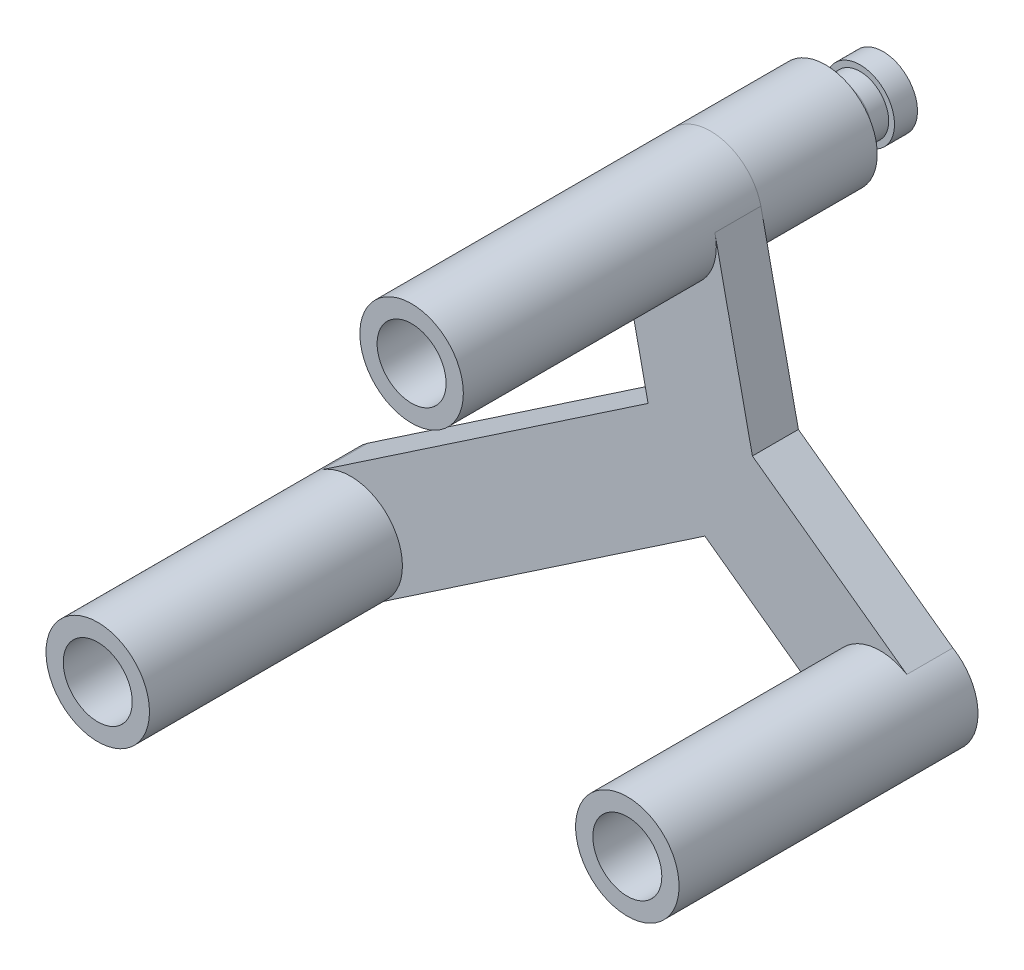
ISO-10303-21;
HEADER;
FILE_DESCRIPTION(('STEP AP214'),'2;1');
FILE_NAME('part.step','',(''),(''),'','','');
FILE_SCHEMA(('AUTOMOTIVE_DESIGN { 1 0 10303 214 1 1 1 1 }'));
ENDSEC;
DATA;
#1=APPLICATION_CONTEXT('core data for automotive mechanical design processes');
#2=APPLICATION_PROTOCOL_DEFINITION('international standard','automotive_design',2000,#1);
#3=PRODUCT_CONTEXT('',#1,'mechanical');
#4=PRODUCT('Part','Part','',(#3));
#5=PRODUCT_RELATED_PRODUCT_CATEGORY('part','',(#4));
#6=PRODUCT_DEFINITION_FORMATION('','',#4);
#7=PRODUCT_DEFINITION_CONTEXT('part definition',#1,'design');
#8=PRODUCT_DEFINITION('design','',#6,#7);
#9=PRODUCT_DEFINITION_SHAPE('','',#8);
#10=(LENGTH_UNIT() NAMED_UNIT(*) SI_UNIT(.MILLI.,.METRE.));
#11=(NAMED_UNIT(*) PLANE_ANGLE_UNIT() SI_UNIT($,.RADIAN.));
#12=(NAMED_UNIT(*) SI_UNIT($,.STERADIAN.) SOLID_ANGLE_UNIT());
#13=UNCERTAINTY_MEASURE_WITH_UNIT(LENGTH_MEASURE(1.E-05),#10,'distance_accuracy_value','');
#14=(GEOMETRIC_REPRESENTATION_CONTEXT(3) GLOBAL_UNCERTAINTY_ASSIGNED_CONTEXT((#13)) GLOBAL_UNIT_ASSIGNED_CONTEXT((#10,
#11,#12)) REPRESENTATION_CONTEXT('',''));
#15=CARTESIAN_POINT('',(0.,0.,0.));
#16=DIRECTION('',(0.,0.,1.));
#17=DIRECTION('',(1.,0.,0.));
#18=AXIS2_PLACEMENT_3D('',#15,#16,#17);
#19=CARTESIAN_POINT('',(0.,0.,-4.));
#20=DIRECTION('',(0.,0.,1.));
#21=DIRECTION('',(1.,0.,0.));
#22=AXIS2_PLACEMENT_3D('',#19,#20,#21);
#23=PLANE('',#22);
#24=CARTESIAN_POINT('',(-3.59848546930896,16.7570367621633,-4.));
#25=DIRECTION('',(0.,0.,-1.));
#26=DIRECTION('',(-1.,0.,0.));
#27=AXIS2_PLACEMENT_3D('',#24,#25,#26);
#28=CIRCLE('',#27,4.49893757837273);
#29=CARTESIAN_POINT('',(-8.04749548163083,16.0886437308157,-4.));
#30=VERTEX_POINT('',#29);
#31=CARTESIAN_POINT('',(0.80017246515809,17.7016254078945,-4.));
#32=VERTEX_POINT('',#31);
#33=EDGE_CURVE('E58',#30,#32,#28,.T.);
#34=ORIENTED_EDGE('',*,*,#33,.F.);
#35=DIRECTION('',(-0.209958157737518,0.977710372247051,0.));
#36=VECTOR('',#35,1.);
#37=CARTESIAN_POINT('',(-4.39009341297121,-0.942749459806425,-4.));
#38=LINE('',#37,#36);
#39=CARTESIAN_POINT('',(-8.05096977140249,16.1048224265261,-4.));
#40=VERTEX_POINT('',#39);
#41=EDGE_CURVE('E215',#30,#40,#38,.T.);
#42=ORIENTED_EDGE('',*,*,#41,.T.);
#43=CARTESIAN_POINT('',(-3.59848546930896,16.7570367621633,-4.));
#44=DIRECTION('',(0.,0.,1.));
#45=DIRECTION('',(1.,0.,0.));
#46=AXIS2_PLACEMENT_3D('',#43,#44,#45);
#47=CIRCLE('',#46,4.5);
#48=CARTESIAN_POINT('',(0.779643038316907,17.7972246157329,-4.));
#49=VERTEX_POINT('',#48);
#50=EDGE_CURVE('E212',#49,#40,#47,.T.);
#51=ORIENTED_EDGE('',*,*,#50,.F.);
#52=DIRECTION('',(0.209958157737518,-0.977710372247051,0.));
#53=VECTOR('',#52,1.);
#54=CARTESIAN_POINT('',(4.39865793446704,0.944588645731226,-4.));
#55=LINE('',#54,#53);
#56=EDGE_CURVE('E210',#49,#32,#55,.T.);
#57=ORIENTED_EDGE('',*,*,#56,.T.);
#58=EDGE_LOOP('',(#34,#42,#51,#57));
#59=FACE_BOUND('',#58,.T.);
#60=ADVANCED_FACE('F35',(#59),#23,.F.);
#61=CARTESIAN_POINT('',(0.,0.,0.));
#62=DIRECTION('',(0.,0.,1.));
#63=DIRECTION('',(1.,0.,0.));
#64=AXIS2_PLACEMENT_3D('',#61,#62,#63);
#65=PLANE('',#64);
#66=DIRECTION('',(0.809551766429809,-0.587048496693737,0.));
#67=VECTOR('',#66,1.);
#68=CARTESIAN_POINT('',(-2.64171823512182,-3.64298294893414,0.));
#69=LINE('',#68,#67);
#70=CARTESIAN_POINT('',(-0.0904885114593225,-5.49301359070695,0.));
#71=VERTEX_POINT('',#70);
#72=CARTESIAN_POINT('',(12.521976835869,-14.6389745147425,0.));
#73=VERTEX_POINT('',#72);
#74=EDGE_CURVE('E218',#71,#73,#69,.T.);
#75=ORIENTED_EDGE('',*,*,#74,.T.);
#76=CARTESIAN_POINT('',(15.1636950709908,-10.9959915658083,0.));
#77=DIRECTION('',(0.,0.,1.));
#78=DIRECTION('',(1.,0.,0.));
#79=AXIS2_PLACEMENT_3D('',#76,#77,#78);
#80=CIRCLE('',#79,4.5);
#81=CARTESIAN_POINT('',(17.4737197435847,-7.13415443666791,0.));
#82=VERTEX_POINT('',#81);
#83=EDGE_CURVE('E176',#82,#73,#80,.T.);
#84=ORIENTED_EDGE('',*,*,#83,.F.);
#85=DIRECTION('',(0.809551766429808,-0.587048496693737,0.));
#86=VECTOR('',#85,1.);
#87=CARTESIAN_POINT('',(2.63141763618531,3.62877821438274,0.));
#88=LINE('',#87,#86);
#89=CARTESIAN_POINT('',(4.04188395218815,2.60597502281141,0.));
#90=VERTEX_POINT('',#89);
#91=EDGE_CURVE('E270',#90,#82,#88,.T.);
#92=ORIENTED_EDGE('',*,*,#91,.F.);
#93=DIRECTION('',(0.209958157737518,-0.977710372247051,0.));
#94=VECTOR('',#93,1.);
#95=CARTESIAN_POINT('',(4.39865793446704,0.944588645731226,0.));
#96=LINE('',#95,#94);
#97=CARTESIAN_POINT('',(0.820701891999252,17.6060262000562,0.));
#98=VERTEX_POINT('',#97);
#99=EDGE_CURVE('E268',#98,#90,#96,.T.);
#100=ORIENTED_EDGE('',*,*,#99,.F.);
#101=CARTESIAN_POINT('',(-3.59848546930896,16.7570367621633,0.));
#102=DIRECTION('',(0.,0.,1.));
#103=DIRECTION('',(1.,0.,0.));
#104=AXIS2_PLACEMENT_3D('',#101,#102,#103);
#105=CIRCLE('',#104,4.5);
#106=CARTESIAN_POINT('',(-7.92618799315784,15.5237521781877,0.));
#107=VERTEX_POINT('',#106);
#108=EDGE_CURVE('E187',#107,#98,#105,.T.);
#109=ORIENTED_EDGE('',*,*,#108,.F.);
#110=DIRECTION('',(-0.209958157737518,0.977710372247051,0.));
#111=VECTOR('',#110,1.);
#112=CARTESIAN_POINT('',(-4.39009341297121,-0.942749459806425,0.));
#113=LINE('',#112,#111);
#114=CARTESIAN_POINT('',(-5.02892290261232,2.03208240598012,0.));
#115=VERTEX_POINT('',#114);
#116=EDGE_CURVE('E195',#115,#107,#113,.T.);
#117=ORIENTED_EDGE('',*,*,#116,.F.);
#118=DIRECTION('',(0.828448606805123,0.560065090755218,0.));
#119=VECTOR('',#118,1.);
#120=CARTESIAN_POINT('',(-2.52029290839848,3.72801873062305,0.));
#121=LINE('',#120,#119);
#122=CARTESIAN_POINT('',(-33.4165334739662,-17.1591016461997,0.));
#123=VERTEX_POINT('',#122);
#124=EDGE_CURVE('E304',#123,#115,#121,.T.);
#125=ORIENTED_EDGE('',*,*,#124,.F.);
#126=CARTESIAN_POINT('',(-30.8962405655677,-20.8871203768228,0.));
#127=DIRECTION('',(0.,0.,1.));
#128=DIRECTION('',(1.,0.,0.));
#129=AXIS2_PLACEMENT_3D('',#126,#127,#128);
#130=CIRCLE('',#129,4.5);
#131=CARTESIAN_POINT('',(-28.3759476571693,-24.6151391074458,0.));
#132=VERTEX_POINT('',#131);
#133=EDGE_CURVE('E286',#132,#123,#130,.T.);
#134=ORIENTED_EDGE('',*,*,#133,.F.);
#135=DIRECTION('',(0.828448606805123,0.560065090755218,0.));
#136=VECTOR('',#135,1.);
#137=CARTESIAN_POINT('',(2.52029290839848,-3.72801873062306,0.));
#138=LINE('',#137,#136);
#139=EDGE_CURVE('E280',#132,#71,#138,.T.);
#140=ORIENTED_EDGE('',*,*,#139,.T.);
#141=EDGE_LOOP('',(#75,#84,#92,#100,#109,#117,#125,#134,#140));
#142=FACE_BOUND('',#141,.T.);
#143=ADVANCED_FACE('F321',(#142),#65,.T.);
#144=CARTESIAN_POINT('',(-30.8962405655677,-20.8871203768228,22.));
#145=DIRECTION('',(0.,0.,-1.));
#146=DIRECTION('',(-1.,0.,0.));
#147=AXIS2_PLACEMENT_3D('',#144,#145,#146);
#148=CYLINDRICAL_SURFACE('',#147,4.5);
#149=CARTESIAN_POINT('',(-30.8962405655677,-20.8871203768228,22.));
#150=DIRECTION('',(0.,0.,1.));
#151=DIRECTION('',(1.,0.,0.));
#152=AXIS2_PLACEMENT_3D('',#149,#150,#151);
#153=CIRCLE('',#152,4.5);
#154=CARTESIAN_POINT('',(-26.3962405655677,-20.8871203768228,22.));
#155=VERTEX_POINT('',#154);
#156=EDGE_CURVE('E297',#155,#155,#153,.T.);
#157=ORIENTED_EDGE('',*,*,#156,.F.);
#158=EDGE_LOOP('',(#157));
#159=FACE_BOUND('',#158,.T.);
#160=ORIENTED_EDGE('',*,*,#133,.T.);
#161=DIRECTION('',(0.,0.,1.));
#162=VECTOR('',#161,1.);
#163=CARTESIAN_POINT('',(-33.4165334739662,-17.1591016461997,-4.));
#164=LINE('',#163,#162);
#165=CARTESIAN_POINT('',(-33.4165334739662,-17.1591016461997,-4.));
#166=VERTEX_POINT('',#165);
#167=EDGE_CURVE('E224',#166,#123,#164,.T.);
#168=ORIENTED_EDGE('',*,*,#167,.F.);
#169=CARTESIAN_POINT('',(-30.8962405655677,-20.8871203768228,-4.));
#170=DIRECTION('',(0.,0.,1.));
#171=DIRECTION('',(1.,0.,0.));
#172=AXIS2_PLACEMENT_3D('',#169,#170,#171);
#173=CIRCLE('',#172,4.5);
#174=CARTESIAN_POINT('',(-28.3759476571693,-24.6151391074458,-4.));
#175=VERTEX_POINT('',#174);
#176=EDGE_CURVE('E194',#166,#175,#173,.T.);
#177=ORIENTED_EDGE('',*,*,#176,.T.);
#178=DIRECTION('',(0.,0.,1.));
#179=VECTOR('',#178,1.);
#180=CARTESIAN_POINT('',(-28.3759476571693,-24.6151391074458,-4.));
#181=LINE('',#180,#179);
#182=EDGE_CURVE('E296',#175,#132,#181,.T.);
#183=ORIENTED_EDGE('',*,*,#182,.T.);
#184=EDGE_LOOP('',(#160,#168,#177,#183));
#185=FACE_BOUND('',#184,.T.);
#186=ADVANCED_FACE('F349',(#159,#185),#148,.T.);
#187=CARTESIAN_POINT('',(-30.8962405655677,-20.8871203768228,22.));
#188=DIRECTION('',(0.,0.,1.));
#189=DIRECTION('',(1.,0.,0.));
#190=AXIS2_PLACEMENT_3D('',#187,#188,#189);
#191=PLANE('',#190);
#192=CARTESIAN_POINT('',(-30.8962405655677,-20.8871203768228,22.));
#193=DIRECTION('',(0.,0.,1.));
#194=DIRECTION('',(1.,0.,0.));
#195=AXIS2_PLACEMENT_3D('',#192,#193,#194);
#196=CIRCLE('',#195,3.);
#197=CARTESIAN_POINT('',(-27.8962405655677,-20.8871203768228,22.));
#198=VERTEX_POINT('',#197);
#199=EDGE_CURVE('E167',#198,#198,#196,.T.);
#200=ORIENTED_EDGE('',*,*,#199,.F.);
#201=EDGE_LOOP('',(#200));
#202=FACE_BOUND('',#201,.T.);
#203=ORIENTED_EDGE('',*,*,#156,.T.);
#204=EDGE_LOOP('',(#203));
#205=FACE_BOUND('',#204,.T.);
#206=ADVANCED_FACE('F351',(#202,#205),#191,.T.);
#207=CARTESIAN_POINT('',(-2.52029290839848,3.72801873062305,-4.));
#208=DIRECTION('',(0.560065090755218,-0.828448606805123,0.));
#209=DIRECTION('',(0.828448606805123,0.560065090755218,0.));
#210=AXIS2_PLACEMENT_3D('',#207,#208,#209);
#211=PLANE('',#210);
#212=ORIENTED_EDGE('',*,*,#124,.T.);
#213=DIRECTION('',(0.,0.,1.));
#214=VECTOR('',#213,1.);
#215=CARTESIAN_POINT('',(-5.02892290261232,2.03208240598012,-4.));
#216=LINE('',#215,#214);
#217=CARTESIAN_POINT('',(-5.02892290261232,2.03208240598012,-4.));
#218=VERTEX_POINT('',#217);
#219=EDGE_CURVE('E283',#218,#115,#216,.T.);
#220=ORIENTED_EDGE('',*,*,#219,.F.);
#221=DIRECTION('',(0.828448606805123,0.560065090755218,0.));
#222=VECTOR('',#221,1.);
#223=CARTESIAN_POINT('',(-2.52029290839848,3.72801873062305,-4.));
#224=LINE('',#223,#222);
#225=EDGE_CURVE('E191',#166,#218,#224,.T.);
#226=ORIENTED_EDGE('',*,*,#225,.F.);
#227=ORIENTED_EDGE('',*,*,#167,.T.);
#228=EDGE_LOOP('',(#212,#220,#226,#227));
#229=FACE_BOUND('',#228,.T.);
#230=ADVANCED_FACE('F346',(#229),#211,.F.);
#231=CARTESIAN_POINT('',(-4.39009341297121,-0.942749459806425,-4.));
#232=DIRECTION('',(0.977710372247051,0.209958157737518,0.));
#233=DIRECTION('',(-0.209958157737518,0.977710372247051,0.));
#234=AXIS2_PLACEMENT_3D('',#231,#232,#233);
#235=PLANE('',#234);
#236=ORIENTED_EDGE('',*,*,#116,.T.);
#237=DIRECTION('',(0.209958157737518,-0.977710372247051,0.));
#238=VECTOR('',#237,1.);
#239=CARTESIAN_POINT('',(-4.39009341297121,-0.942749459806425,0.));
#240=LINE('',#239,#238);
#241=CARTESIAN_POINT('',(-8.05096977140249,16.1048224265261,0.));
#242=VERTEX_POINT('',#241);
#243=EDGE_CURVE('E186',#242,#107,#240,.T.);
#244=ORIENTED_EDGE('',*,*,#243,.F.);
#245=DIRECTION('',(0.,0.,1.));
#246=VECTOR('',#245,1.);
#247=CARTESIAN_POINT('',(-8.05096977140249,16.1048224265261,-4.));
#248=LINE('',#247,#246);
#249=EDGE_CURVE('E264',#40,#242,#248,.T.);
#250=ORIENTED_EDGE('',*,*,#249,.F.);
#251=ORIENTED_EDGE('',*,*,#41,.F.);
#252=DIRECTION('',(0.,0.,1.));
#253=VECTOR('',#252,1.);
#254=CARTESIAN_POINT('',(-8.04749548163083,16.0886437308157,-14.));
#255=LINE('',#254,#253);
#256=CARTESIAN_POINT('',(-8.04749548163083,16.0886437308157,-14.));
#257=VERTEX_POINT('',#256);
#258=EDGE_CURVE('E135',#257,#30,#255,.T.);
#259=ORIENTED_EDGE('',*,*,#258,.F.);
#260=DIRECTION('',(-0.209958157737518,0.977710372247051,0.));
#261=VECTOR('',#260,1.);
#262=CARTESIAN_POINT('',(-4.39009341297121,-0.942749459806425,-14.));
#263=LINE('',#262,#261);
#264=CARTESIAN_POINT('',(-7.92966228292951,15.539930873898,-14.));
#265=VERTEX_POINT('',#264);
#266=EDGE_CURVE('E128',#265,#257,#263,.T.);
#267=ORIENTED_EDGE('',*,*,#266,.F.);
#268=DIRECTION('',(0.,0.,1.));
#269=VECTOR('',#268,1.);
#270=CARTESIAN_POINT('',(-7.92966228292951,15.539930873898,-14.));
#271=LINE('',#270,#269);
#272=CARTESIAN_POINT('',(-7.92966228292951,15.539930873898,-4.));
#273=VERTEX_POINT('',#272);
#274=EDGE_CURVE('E133',#265,#273,#271,.T.);
#275=ORIENTED_EDGE('',*,*,#274,.T.);
#276=EDGE_CURVE('E222',#218,#273,#38,.T.);
#277=ORIENTED_EDGE('',*,*,#276,.F.);
#278=ORIENTED_EDGE('',*,*,#219,.T.);
#279=EDGE_LOOP('',(#236,#244,#250,#251,#259,#267,#275,#277,#278));
#280=FACE_BOUND('',#279,.T.);
#281=ADVANCED_FACE('F131',(#280),#235,.F.);
#282=CARTESIAN_POINT('',(-3.59848546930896,16.7570367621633,-4.));
#283=DIRECTION('',(0.,0.,1.));
#284=DIRECTION('',(1.,0.,0.));
#285=AXIS2_PLACEMENT_3D('',#282,#283,#284);
#286=CYLINDRICAL_SURFACE('',#285,4.5);
#287=ORIENTED_EDGE('',*,*,#249,.T.);
#288=EDGE_CURVE('E182',#242,#107,#105,.T.);
#289=ORIENTED_EDGE('',*,*,#288,.T.);
#290=ORIENTED_EDGE('',*,*,#108,.T.);
#291=CARTESIAN_POINT('',(0.779643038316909,17.7972246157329,0.));
#292=DIRECTION('',(0.209958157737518,-0.977710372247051,0.));
#293=VECTOR('',#292,1.);
#294=LINE('',#291,#293);
#295=CARTESIAN_POINT('',(0.779643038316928,17.7972246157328,0.));
#296=VERTEX_POINT('',#295);
#297=EDGE_CURVE('E269',#296,#98,#294,.T.);
#298=ORIENTED_EDGE('',*,*,#297,.F.);
#299=DIRECTION('',(0.,0.,1.));
#300=VECTOR('',#299,1.);
#301=CARTESIAN_POINT('',(0.779643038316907,17.7972246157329,-4.));
#302=LINE('',#301,#300);
#303=EDGE_CURVE('E256',#49,#296,#302,.T.);
#304=ORIENTED_EDGE('',*,*,#303,.F.);
#305=ORIENTED_EDGE('',*,*,#50,.T.);
#306=EDGE_LOOP('',(#287,#289,#290,#298,#304,#305));
#307=FACE_BOUND('',#306,.T.);
#308=CARTESIAN_POINT('',(-3.59848546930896,16.7570367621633,22.));
#309=DIRECTION('',(0.,0.,1.));
#310=DIRECTION('',(1.,0.,0.));
#311=AXIS2_PLACEMENT_3D('',#308,#309,#310);
#312=CIRCLE('',#311,4.5);
#313=CARTESIAN_POINT('',(0.901514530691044,16.7570367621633,22.));
#314=VERTEX_POINT('',#313);
#315=EDGE_CURVE('E179',#314,#314,#312,.T.);
#316=ORIENTED_EDGE('',*,*,#315,.F.);
#317=EDGE_LOOP('',(#316));
#318=FACE_BOUND('',#317,.T.);
#319=ADVANCED_FACE('F230',(#307,#318),#286,.T.);
#320=CARTESIAN_POINT('',(4.39865793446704,0.944588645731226,-4.));
#321=DIRECTION('',(-0.977710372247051,-0.209958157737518,0.));
#322=DIRECTION('',(0.209958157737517,-0.977710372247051,0.));
#323=AXIS2_PLACEMENT_3D('',#320,#321,#322);
#324=PLANE('',#323);
#325=ORIENTED_EDGE('',*,*,#297,.T.);
#326=ORIENTED_EDGE('',*,*,#99,.T.);
#327=DIRECTION('',(0.,0.,1.));
#328=VECTOR('',#327,1.);
#329=CARTESIAN_POINT('',(4.04188395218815,2.60597502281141,-4.));
#330=LINE('',#329,#328);
#331=CARTESIAN_POINT('',(4.04188395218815,2.60597502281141,-4.));
#332=VERTEX_POINT('',#331);
#333=EDGE_CURVE('E265',#332,#90,#330,.T.);
#334=ORIENTED_EDGE('',*,*,#333,.F.);
#335=EDGE_CURVE('E209',#32,#332,#55,.T.);
#336=ORIENTED_EDGE('',*,*,#335,.F.);
#337=ORIENTED_EDGE('',*,*,#56,.F.);
#338=ORIENTED_EDGE('',*,*,#303,.T.);
#339=EDGE_LOOP('',(#325,#326,#334,#336,#337,#338));
#340=FACE_BOUND('',#339,.T.);
#341=ADVANCED_FACE('F240',(#340),#324,.F.);
#342=CARTESIAN_POINT('',(2.63141763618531,3.62877821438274,-4.));
#343=DIRECTION('',(-0.587048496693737,-0.809551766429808,0.));
#344=DIRECTION('',(0.809551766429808,-0.587048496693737,0.));
#345=AXIS2_PLACEMENT_3D('',#342,#343,#344);
#346=PLANE('',#345);
#347=ORIENTED_EDGE('',*,*,#91,.T.);
#348=DIRECTION('',(0.,0.,1.));
#349=VECTOR('',#348,1.);
#350=CARTESIAN_POINT('',(17.4737197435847,-7.13415443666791,-4.));
#351=LINE('',#350,#349);
#352=CARTESIAN_POINT('',(17.4737197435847,-7.13415443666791,-4.));
#353=VERTEX_POINT('',#352);
#354=EDGE_CURVE('E290',#353,#82,#351,.T.);
#355=ORIENTED_EDGE('',*,*,#354,.F.);
#356=DIRECTION('',(0.809551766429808,-0.587048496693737,0.));
#357=VECTOR('',#356,1.);
#358=CARTESIAN_POINT('',(2.63141763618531,3.62877821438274,-4.));
#359=LINE('',#358,#357);
#360=EDGE_CURVE('E207',#332,#353,#359,.T.);
#361=ORIENTED_EDGE('',*,*,#360,.F.);
#362=ORIENTED_EDGE('',*,*,#333,.T.);
#363=EDGE_LOOP('',(#347,#355,#361,#362));
#364=FACE_BOUND('',#363,.T.);
#365=ADVANCED_FACE('F246',(#364),#346,.F.);
#366=CARTESIAN_POINT('',(15.1636950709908,-10.9959915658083,-4.));
#367=DIRECTION('',(0.,0.,1.));
#368=DIRECTION('',(1.,0.,0.));
#369=AXIS2_PLACEMENT_3D('',#366,#367,#368);
#370=CYLINDRICAL_SURFACE('',#369,4.5);
#371=ORIENTED_EDGE('',*,*,#354,.T.);
#372=ORIENTED_EDGE('',*,*,#83,.T.);
#373=DIRECTION('',(0.,0.,1.));
#374=VECTOR('',#373,1.);
#375=CARTESIAN_POINT('',(12.521976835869,-14.6389745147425,-4.));
#376=LINE('',#375,#374);
#377=CARTESIAN_POINT('',(12.521976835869,-14.6389745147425,-4.));
#378=VERTEX_POINT('',#377);
#379=EDGE_CURVE('E292',#378,#73,#376,.T.);
#380=ORIENTED_EDGE('',*,*,#379,.F.);
#381=CARTESIAN_POINT('',(15.1636950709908,-10.9959915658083,-4.));
#382=DIRECTION('',(0.,0.,1.));
#383=DIRECTION('',(1.,0.,0.));
#384=AXIS2_PLACEMENT_3D('',#381,#382,#383);
#385=CIRCLE('',#384,4.5);
#386=EDGE_CURVE('E204',#378,#353,#385,.T.);
#387=ORIENTED_EDGE('',*,*,#386,.T.);
#388=EDGE_LOOP('',(#371,#372,#380,#387));
#389=FACE_BOUND('',#388,.T.);
#390=CARTESIAN_POINT('',(15.1636950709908,-10.9959915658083,22.));
#391=DIRECTION('',(0.,0.,1.));
#392=DIRECTION('',(1.,0.,0.));
#393=AXIS2_PLACEMENT_3D('',#390,#391,#392);
#394=CIRCLE('',#393,4.5);
#395=CARTESIAN_POINT('',(19.6636950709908,-10.9959915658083,22.));
#396=VERTEX_POINT('',#395);
#397=EDGE_CURVE('E173',#396,#396,#394,.T.);
#398=ORIENTED_EDGE('',*,*,#397,.F.);
#399=EDGE_LOOP('',(#398));
#400=FACE_BOUND('',#399,.T.);
#401=ADVANCED_FACE('F332',(#389,#400),#370,.T.);
#402=CARTESIAN_POINT('',(-2.64171823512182,-3.64298294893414,-4.));
#403=DIRECTION('',(-0.587048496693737,-0.809551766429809,0.));
#404=DIRECTION('',(0.809551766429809,-0.587048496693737,0.));
#405=AXIS2_PLACEMENT_3D('',#402,#403,#404);
#406=PLANE('',#405);
#407=ORIENTED_EDGE('',*,*,#74,.F.);
#408=DIRECTION('',(0.,0.,1.));
#409=VECTOR('',#408,1.);
#410=CARTESIAN_POINT('',(-0.0904885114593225,-5.49301359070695,-4.));
#411=LINE('',#410,#409);
#412=CARTESIAN_POINT('',(-0.0904885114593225,-5.49301359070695,-4.));
#413=VERTEX_POINT('',#412);
#414=EDGE_CURVE('E294',#413,#71,#411,.T.);
#415=ORIENTED_EDGE('',*,*,#414,.F.);
#416=DIRECTION('',(0.809551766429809,-0.587048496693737,0.));
#417=VECTOR('',#416,1.);
#418=CARTESIAN_POINT('',(-2.64171823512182,-3.64298294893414,-4.));
#419=LINE('',#418,#417);
#420=EDGE_CURVE('E201',#413,#378,#419,.T.);
#421=ORIENTED_EDGE('',*,*,#420,.T.);
#422=ORIENTED_EDGE('',*,*,#379,.T.);
#423=EDGE_LOOP('',(#407,#415,#421,#422));
#424=FACE_BOUND('',#423,.T.);
#425=ADVANCED_FACE('F329',(#424),#406,.T.);
#426=CARTESIAN_POINT('',(2.52029290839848,-3.72801873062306,-4.));
#427=DIRECTION('',(0.560065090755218,-0.828448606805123,0.));
#428=DIRECTION('',(0.828448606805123,0.560065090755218,0.));
#429=AXIS2_PLACEMENT_3D('',#426,#427,#428);
#430=PLANE('',#429);
#431=ORIENTED_EDGE('',*,*,#139,.F.);
#432=ORIENTED_EDGE('',*,*,#182,.F.);
#433=DIRECTION('',(0.828448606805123,0.560065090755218,0.));
#434=VECTOR('',#433,1.);
#435=CARTESIAN_POINT('',(2.52029290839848,-3.72801873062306,-4.));
#436=LINE('',#435,#434);
#437=EDGE_CURVE('E198',#175,#413,#436,.T.);
#438=ORIENTED_EDGE('',*,*,#437,.T.);
#439=ORIENTED_EDGE('',*,*,#414,.T.);
#440=EDGE_LOOP('',(#431,#432,#438,#439));
#441=FACE_BOUND('',#440,.T.);
#442=ADVANCED_FACE('F325',(#441),#430,.T.);
#443=EDGE_CURVE('E50',#32,#273,#28,.T.);
#444=ORIENTED_EDGE('',*,*,#443,.F.);
#445=ORIENTED_EDGE('',*,*,#335,.T.);
#446=ORIENTED_EDGE('',*,*,#360,.T.);
#447=ORIENTED_EDGE('',*,*,#386,.F.);
#448=ORIENTED_EDGE('',*,*,#420,.F.);
#449=ORIENTED_EDGE('',*,*,#437,.F.);
#450=ORIENTED_EDGE('',*,*,#176,.F.);
#451=ORIENTED_EDGE('',*,*,#225,.T.);
#452=ORIENTED_EDGE('',*,*,#276,.T.);
#453=EDGE_LOOP('',(#444,#445,#446,#447,#448,#449,#450,#451,#452));
#454=FACE_BOUND('',#453,.T.);
#455=ADVANCED_FACE('F334',(#454),#23,.F.);
#456=CARTESIAN_POINT('',(-3.59848546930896,16.7570367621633,0.));
#457=DIRECTION('',(0.,0.,1.));
#458=DIRECTION('',(1.,0.,0.));
#459=AXIS2_PLACEMENT_3D('',#456,#457,#458);
#460=PLANE('',#459);
#461=ORIENTED_EDGE('',*,*,#288,.F.);
#462=ORIENTED_EDGE('',*,*,#243,.T.);
#463=EDGE_LOOP('',(#461,#462));
#464=FACE_BOUND('',#463,.T.);
#465=ADVANCED_FACE('F342',(#464),#460,.F.);
#466=CARTESIAN_POINT('',(-3.59848546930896,16.7570367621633,22.));
#467=DIRECTION('',(0.,0.,1.));
#468=DIRECTION('',(1.,0.,0.));
#469=AXIS2_PLACEMENT_3D('',#466,#467,#468);
#470=PLANE('',#469);
#471=CARTESIAN_POINT('',(-3.59848546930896,16.7570367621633,22.));
#472=DIRECTION('',(0.,0.,1.));
#473=DIRECTION('',(1.,0.,0.));
#474=AXIS2_PLACEMENT_3D('',#471,#472,#473);
#475=CIRCLE('',#474,3.);
#476=CARTESIAN_POINT('',(-0.598485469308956,16.7570367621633,22.));
#477=VERTEX_POINT('',#476);
#478=EDGE_CURVE('E162',#477,#477,#475,.T.);
#479=ORIENTED_EDGE('',*,*,#478,.F.);
#480=EDGE_LOOP('',(#479));
#481=FACE_BOUND('',#480,.T.);
#482=ORIENTED_EDGE('',*,*,#315,.T.);
#483=EDGE_LOOP('',(#482));
#484=FACE_BOUND('',#483,.T.);
#485=ADVANCED_FACE('F373',(#481,#484),#470,.T.);
#486=CARTESIAN_POINT('',(15.1636950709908,-10.9959915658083,22.));
#487=DIRECTION('',(0.,0.,1.));
#488=DIRECTION('',(1.,0.,0.));
#489=AXIS2_PLACEMENT_3D('',#486,#487,#488);
#490=PLANE('',#489);
#491=CARTESIAN_POINT('',(15.1636950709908,-10.9959915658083,22.));
#492=DIRECTION('',(0.,0.,1.));
#493=DIRECTION('',(1.,0.,0.));
#494=AXIS2_PLACEMENT_3D('',#491,#492,#493);
#495=CIRCLE('',#494,3.);
#496=CARTESIAN_POINT('',(18.1636950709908,-10.9959915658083,22.));
#497=VERTEX_POINT('',#496);
#498=EDGE_CURVE('E144',#497,#497,#495,.T.);
#499=ORIENTED_EDGE('',*,*,#498,.F.);
#500=EDGE_LOOP('',(#499));
#501=FACE_BOUND('',#500,.T.);
#502=ORIENTED_EDGE('',*,*,#397,.T.);
#503=EDGE_LOOP('',(#502));
#504=FACE_BOUND('',#503,.T.);
#505=ADVANCED_FACE('F497',(#501,#504),#490,.T.);
#506=CARTESIAN_POINT('',(-30.8962405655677,-20.8871203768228,14.));
#507=DIRECTION('',(0.,0.,1.));
#508=DIRECTION('',(1.,0.,0.));
#509=AXIS2_PLACEMENT_3D('',#506,#507,#508);
#510=CYLINDRICAL_SURFACE('',#509,3.);
#511=CARTESIAN_POINT('',(-30.8962405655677,-20.8871203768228,14.));
#512=DIRECTION('',(0.,0.,1.));
#513=DIRECTION('',(1.,0.,0.));
#514=AXIS2_PLACEMENT_3D('',#511,#512,#513);
#515=CIRCLE('',#514,3.);
#516=CARTESIAN_POINT('',(-27.8962405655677,-20.8871203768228,14.));
#517=VERTEX_POINT('',#516);
#518=EDGE_CURVE('E170',#517,#517,#515,.T.);
#519=ORIENTED_EDGE('',*,*,#518,.F.);
#520=EDGE_LOOP('',(#519));
#521=FACE_BOUND('',#520,.T.);
#522=ORIENTED_EDGE('',*,*,#199,.T.);
#523=EDGE_LOOP('',(#522));
#524=FACE_BOUND('',#523,.T.);
#525=ADVANCED_FACE('F493',(#521,#524),#510,.F.);
#526=CARTESIAN_POINT('',(-30.8962405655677,-20.8871203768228,14.));
#527=DIRECTION('',(0.,0.,1.));
#528=DIRECTION('',(1.,0.,0.));
#529=AXIS2_PLACEMENT_3D('',#526,#527,#528);
#530=PLANE('',#529);
#531=ORIENTED_EDGE('',*,*,#518,.T.);
#532=EDGE_LOOP('',(#531));
#533=FACE_BOUND('',#532,.T.);
#534=ADVANCED_FACE('F489',(#533),#530,.T.);
#535=CARTESIAN_POINT('',(-3.59848546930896,16.7570367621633,14.));
#536=DIRECTION('',(0.,0.,1.));
#537=DIRECTION('',(1.,0.,0.));
#538=AXIS2_PLACEMENT_3D('',#535,#536,#537);
#539=CYLINDRICAL_SURFACE('',#538,3.);
#540=CARTESIAN_POINT('',(-3.59848546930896,16.7570367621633,14.));
#541=DIRECTION('',(0.,0.,1.));
#542=DIRECTION('',(1.,0.,0.));
#543=AXIS2_PLACEMENT_3D('',#540,#541,#542);
#544=CIRCLE('',#543,3.);
#545=CARTESIAN_POINT('',(-0.598485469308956,16.7570367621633,14.));
#546=VERTEX_POINT('',#545);
#547=EDGE_CURVE('E164',#546,#546,#544,.T.);
#548=ORIENTED_EDGE('',*,*,#547,.F.);
#549=EDGE_LOOP('',(#548));
#550=FACE_BOUND('',#549,.T.);
#551=ORIENTED_EDGE('',*,*,#478,.T.);
#552=EDGE_LOOP('',(#551));
#553=FACE_BOUND('',#552,.T.);
#554=ADVANCED_FACE('F485',(#550,#553),#539,.F.);
#555=CARTESIAN_POINT('',(-3.59848546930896,16.7570367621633,14.));
#556=DIRECTION('',(0.,0.,1.));
#557=DIRECTION('',(1.,0.,0.));
#558=AXIS2_PLACEMENT_3D('',#555,#556,#557);
#559=PLANE('',#558);
#560=ORIENTED_EDGE('',*,*,#547,.T.);
#561=EDGE_LOOP('',(#560));
#562=FACE_BOUND('',#561,.T.);
#563=ADVANCED_FACE('F481',(#562),#559,.T.);
#564=CARTESIAN_POINT('',(15.1636950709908,-10.9959915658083,14.));
#565=DIRECTION('',(0.,0.,1.));
#566=DIRECTION('',(1.,0.,0.));
#567=AXIS2_PLACEMENT_3D('',#564,#565,#566);
#568=CYLINDRICAL_SURFACE('',#567,3.);
#569=CARTESIAN_POINT('',(15.1636950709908,-10.9959915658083,14.));
#570=DIRECTION('',(0.,0.,1.));
#571=DIRECTION('',(1.,0.,0.));
#572=AXIS2_PLACEMENT_3D('',#569,#570,#571);
#573=CIRCLE('',#572,3.);
#574=CARTESIAN_POINT('',(18.1636950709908,-10.9959915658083,14.));
#575=VERTEX_POINT('',#574);
#576=EDGE_CURVE('E147',#575,#575,#573,.T.);
#577=ORIENTED_EDGE('',*,*,#576,.F.);
#578=EDGE_LOOP('',(#577));
#579=FACE_BOUND('',#578,.T.);
#580=ORIENTED_EDGE('',*,*,#498,.T.);
#581=EDGE_LOOP('',(#580));
#582=FACE_BOUND('',#581,.T.);
#583=ADVANCED_FACE('F477',(#579,#582),#568,.F.);
#584=CARTESIAN_POINT('',(15.1636950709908,-10.9959915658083,14.));
#585=DIRECTION('',(0.,0.,1.));
#586=DIRECTION('',(1.,0.,0.));
#587=AXIS2_PLACEMENT_3D('',#584,#585,#586);
#588=PLANE('',#587);
#589=ORIENTED_EDGE('',*,*,#576,.T.);
#590=EDGE_LOOP('',(#589));
#591=FACE_BOUND('',#590,.T.);
#592=ADVANCED_FACE('F396',(#591),#588,.T.);
#593=CARTESIAN_POINT('',(-3.59848546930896,16.7570367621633,-14.));
#594=DIRECTION('',(0.,0.,1.));
#595=DIRECTION('',(1.,0.,0.));
#596=AXIS2_PLACEMENT_3D('',#593,#594,#595);
#597=CYLINDRICAL_SURFACE('',#596,4.49893757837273);
#598=ORIENTED_EDGE('',*,*,#33,.T.);
#599=ORIENTED_EDGE('',*,*,#443,.T.);
#600=ORIENTED_EDGE('',*,*,#274,.F.);
#601=CARTESIAN_POINT('',(-3.59848546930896,16.7570367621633,-14.));
#602=DIRECTION('',(0.,0.,-1.));
#603=DIRECTION('',(-1.,0.,0.));
#604=AXIS2_PLACEMENT_3D('',#601,#602,#603);
#605=CIRCLE('',#604,4.49893757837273);
#606=EDGE_CURVE('E138',#257,#265,#605,.T.);
#607=ORIENTED_EDGE('',*,*,#606,.F.);
#608=ORIENTED_EDGE('',*,*,#258,.T.);
#609=EDGE_LOOP('',(#598,#599,#600,#607,#608));
#610=FACE_BOUND('',#609,.T.);
#611=ADVANCED_FACE('F143',(#610),#597,.T.);
#612=CARTESIAN_POINT('',(0.,0.,-14.));
#613=DIRECTION('',(0.,0.,-1.));
#614=DIRECTION('',(-1.,0.,0.));
#615=AXIS2_PLACEMENT_3D('',#612,#613,#614);
#616=PLANE('',#615);
#617=CARTESIAN_POINT('',(-3.59848546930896,16.7570367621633,-14.));
#618=DIRECTION('',(0.,0.,-1.));
#619=DIRECTION('',(-1.,0.,0.));
#620=AXIS2_PLACEMENT_3D('',#617,#618,#619);
#621=CIRCLE('',#620,4.);
#622=CARTESIAN_POINT('',(-7.59848546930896,16.7570367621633,-14.));
#623=VERTEX_POINT('',#622);
#624=EDGE_CURVE('E43',#623,#623,#621,.F.);
#625=ORIENTED_EDGE('',*,*,#624,.T.);
#626=EDGE_LOOP('',(#625));
#627=FACE_BOUND('',#626,.T.);
#628=ORIENTED_EDGE('',*,*,#606,.T.);
#629=ORIENTED_EDGE('',*,*,#266,.T.);
#630=EDGE_LOOP('',(#628,#629));
#631=FACE_BOUND('',#630,.T.);
#632=ADVANCED_FACE('F140',(#627,#631),#616,.T.);
#633=CARTESIAN_POINT('',(-3.59848546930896,16.7570367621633,-17.));
#634=DIRECTION('',(0.,0.,1.));
#635=DIRECTION('',(1.,0.,0.));
#636=AXIS2_PLACEMENT_3D('',#633,#634,#635);
#637=CYLINDRICAL_SURFACE('',#636,2.5);
#638=CARTESIAN_POINT('',(-3.59848546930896,16.7570367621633,-15.5));
#639=DIRECTION('',(0.,0.,-1.));
#640=DIRECTION('',(-1.,0.,0.));
#641=AXIS2_PLACEMENT_3D('',#638,#639,#640);
#642=CIRCLE('',#641,2.5);
#643=CARTESIAN_POINT('',(-1.09848546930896,16.7570367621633,-15.5));
#644=VERTEX_POINT('',#643);
#645=EDGE_CURVE('E11',#644,#644,#642,.T.);
#646=CARTESIAN_POINT('',(-3.59848546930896,16.7570367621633,-17.));
#647=DIRECTION('',(0.,0.,-1.));
#648=DIRECTION('',(-1.,0.,0.));
#649=AXIS2_PLACEMENT_3D('',#646,#647,#648);
#650=CIRCLE('',#649,2.5);
#651=CARTESIAN_POINT('',(-1.09848546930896,16.7570367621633,-17.));
#652=VERTEX_POINT('',#651);
#653=EDGE_CURVE('E156',#652,#652,#650,.T.);
#654=CARTESIAN_POINT('',(-1.09848546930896,16.7570367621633,-15.5));
#655=CARTESIAN_POINT('',(-1.09848546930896,16.7570367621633,-15.515625));
#656=CARTESIAN_POINT('',(-1.09848546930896,16.7570367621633,-15.53125));
#657=CARTESIAN_POINT('',(-1.09848546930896,16.7570367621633,-15.5625));
#658=CARTESIAN_POINT('',(-1.09848546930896,16.7570367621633,-15.578125));
#659=CARTESIAN_POINT('',(-1.09848546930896,16.7570367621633,-15.609375));
#660=CARTESIAN_POINT('',(-1.09848546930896,16.7570367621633,-15.625));
#661=CARTESIAN_POINT('',(-1.09848546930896,16.7570367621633,-15.65625));
#662=CARTESIAN_POINT('',(-1.09848546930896,16.7570367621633,-15.671875));
#663=CARTESIAN_POINT('',(-1.09848546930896,16.7570367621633,-15.703125));
#664=CARTESIAN_POINT('',(-1.09848546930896,16.7570367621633,-15.71875));
#665=CARTESIAN_POINT('',(-1.09848546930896,16.7570367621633,-15.75));
#666=CARTESIAN_POINT('',(-1.09848546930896,16.7570367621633,-15.765625));
#667=CARTESIAN_POINT('',(-1.09848546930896,16.7570367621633,-15.796875));
#668=CARTESIAN_POINT('',(-1.09848546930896,16.7570367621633,-15.8125));
#669=CARTESIAN_POINT('',(-1.09848546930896,16.7570367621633,-15.84375));
#670=CARTESIAN_POINT('',(-1.09848546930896,16.7570367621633,-15.859375));
#671=CARTESIAN_POINT('',(-1.09848546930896,16.7570367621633,-15.890625));
#672=CARTESIAN_POINT('',(-1.09848546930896,16.7570367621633,-15.90625));
#673=CARTESIAN_POINT('',(-1.09848546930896,16.7570367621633,-15.9375));
#674=CARTESIAN_POINT('',(-1.09848546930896,16.7570367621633,-15.953125));
#675=CARTESIAN_POINT('',(-1.09848546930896,16.7570367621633,-15.984375));
#676=CARTESIAN_POINT('',(-1.09848546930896,16.7570367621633,-16.));
#677=CARTESIAN_POINT('',(-1.09848546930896,16.7570367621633,-16.03125));
#678=CARTESIAN_POINT('',(-1.09848546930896,16.7570367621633,-16.046875));
#679=CARTESIAN_POINT('',(-1.09848546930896,16.7570367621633,-16.078125));
#680=CARTESIAN_POINT('',(-1.09848546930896,16.7570367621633,-16.09375));
#681=CARTESIAN_POINT('',(-1.09848546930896,16.7570367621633,-16.125));
#682=CARTESIAN_POINT('',(-1.09848546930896,16.7570367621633,-16.140625));
#683=CARTESIAN_POINT('',(-1.09848546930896,16.7570367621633,-16.171875));
#684=CARTESIAN_POINT('',(-1.09848546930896,16.7570367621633,-16.1875));
#685=CARTESIAN_POINT('',(-1.09848546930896,16.7570367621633,-16.21875));
#686=CARTESIAN_POINT('',(-1.09848546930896,16.7570367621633,-16.234375));
#687=CARTESIAN_POINT('',(-1.09848546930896,16.7570367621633,-16.265625));
#688=CARTESIAN_POINT('',(-1.09848546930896,16.7570367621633,-16.28125));
#689=CARTESIAN_POINT('',(-1.09848546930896,16.7570367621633,-16.3125));
#690=CARTESIAN_POINT('',(-1.09848546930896,16.7570367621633,-16.328125));
#691=CARTESIAN_POINT('',(-1.09848546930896,16.7570367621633,-16.359375));
#692=CARTESIAN_POINT('',(-1.09848546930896,16.7570367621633,-16.375));
#693=CARTESIAN_POINT('',(-1.09848546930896,16.7570367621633,-16.40625));
#694=CARTESIAN_POINT('',(-1.09848546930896,16.7570367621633,-16.421875));
#695=CARTESIAN_POINT('',(-1.09848546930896,16.7570367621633,-16.453125));
#696=CARTESIAN_POINT('',(-1.09848546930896,16.7570367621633,-16.46875));
#697=CARTESIAN_POINT('',(-1.09848546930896,16.7570367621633,-16.5));
#698=CARTESIAN_POINT('',(-1.09848546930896,16.7570367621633,-16.515625));
#699=CARTESIAN_POINT('',(-1.09848546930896,16.7570367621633,-16.546875));
#700=CARTESIAN_POINT('',(-1.09848546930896,16.7570367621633,-16.5625));
#701=CARTESIAN_POINT('',(-1.09848546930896,16.7570367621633,-16.59375));
#702=CARTESIAN_POINT('',(-1.09848546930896,16.7570367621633,-16.609375));
#703=CARTESIAN_POINT('',(-1.09848546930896,16.7570367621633,-16.640625));
#704=CARTESIAN_POINT('',(-1.09848546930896,16.7570367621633,-16.65625));
#705=CARTESIAN_POINT('',(-1.09848546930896,16.7570367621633,-16.6875));
#706=CARTESIAN_POINT('',(-1.09848546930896,16.7570367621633,-16.703125));
#707=CARTESIAN_POINT('',(-1.09848546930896,16.7570367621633,-16.734375));
#708=CARTESIAN_POINT('',(-1.09848546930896,16.7570367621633,-16.75));
#709=CARTESIAN_POINT('',(-1.09848546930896,16.7570367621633,-16.78125));
#710=CARTESIAN_POINT('',(-1.09848546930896,16.7570367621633,-16.796875));
#711=CARTESIAN_POINT('',(-1.09848546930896,16.7570367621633,-16.828125));
#712=CARTESIAN_POINT('',(-1.09848546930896,16.7570367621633,-16.84375));
#713=CARTESIAN_POINT('',(-1.09848546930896,16.7570367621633,-16.875));
#714=CARTESIAN_POINT('',(-1.09848546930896,16.7570367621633,-16.890625));
#715=CARTESIAN_POINT('',(-1.09848546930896,16.7570367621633,-16.921875));
#716=CARTESIAN_POINT('',(-1.09848546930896,16.7570367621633,-16.9375));
#717=CARTESIAN_POINT('',(-1.09848546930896,16.7570367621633,-16.96875));
#718=CARTESIAN_POINT('',(-1.09848546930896,16.7570367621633,-16.984375));
#719=CARTESIAN_POINT('',(-1.09848546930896,16.7570367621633,-17.));
#720=B_SPLINE_CURVE_WITH_KNOTS('',3,(#654,#655,#656,#657,#658,#659,#660,#661,#662,#663,#664,
#665,#666,#667,#668,#669,#670,#671,#672,#673,#674,#675,#676,#677,#678,#679,#680,#681,#682,#683,
#684,#685,#686,#687,#688,#689,#690,#691,#692,#693,#694,#695,#696,#697,#698,#699,#700,#701,#702,
#703,#704,#705,#706,#707,#708,#709,#710,#711,#712,#713,#714,#715,#716,#717,#718,#719),
.UNSPECIFIED.,.F.,.F.,(4,2,2,2,2,2,2,2,2,2,2,2,2,2,2,2,2,2,2,2,2,2,2,2,2,2,2,2,2,2,2,2,4),(0.,
0.046875,0.0937500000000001,0.140625,0.187500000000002,0.234375,0.281250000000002,0.328125,
0.375000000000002,0.421875,0.468750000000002,0.515625,0.562500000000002,0.609375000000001,
0.656250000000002,0.703125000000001,0.750000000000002,0.796875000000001,0.843750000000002,
0.890625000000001,0.937500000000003,0.984375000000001,1.03125,1.078125,1.125,1.171875,1.21875,
1.265625,1.3125,1.359375,1.40625,1.453125,1.5),.UNSPECIFIED.);
#721=EDGE_CURVE('BSEAM405',#644,#652,#720,.T.);
#722=ORIENTED_EDGE('',*,*,#645,.T.);
#723=ORIENTED_EDGE('',*,*,#653,.F.);
#724=ORIENTED_EDGE('',*,*,#721,.T.);
#725=ORIENTED_EDGE('',*,*,#721,.F.);
#726=EDGE_LOOP('',(#722,#724,#723,#725));
#727=FACE_BOUND('',#726,.T.);
#728=ADVANCED_FACE('F405',(#727),#637,.T.);
#729=CARTESIAN_POINT('',(-3.59848546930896,16.7570367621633,-19.));
#730=DIRECTION('',(0.,0.,1.));
#731=DIRECTION('',(1.,0.,0.));
#732=AXIS2_PLACEMENT_3D('',#729,#730,#731);
#733=CYLINDRICAL_SURFACE('',#732,3.);
#734=CARTESIAN_POINT('',(-3.59848546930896,16.7570367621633,-19.));
#735=DIRECTION('',(0.,0.,-1.));
#736=DIRECTION('',(-1.,0.,0.));
#737=AXIS2_PLACEMENT_3D('',#734,#735,#736);
#738=CIRCLE('',#737,3.);
#739=CARTESIAN_POINT('',(-6.59848546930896,16.7570367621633,-19.));
#740=VERTEX_POINT('',#739);
#741=EDGE_CURVE('E464',#740,#740,#738,.T.);
#742=ORIENTED_EDGE('',*,*,#741,.F.);
#743=EDGE_LOOP('',(#742));
#744=FACE_BOUND('',#743,.T.);
#745=CARTESIAN_POINT('',(-3.59848546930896,16.7570367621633,-17.));
#746=DIRECTION('',(0.,0.,-1.));
#747=DIRECTION('',(-1.,0.,0.));
#748=AXIS2_PLACEMENT_3D('',#745,#746,#747);
#749=CIRCLE('',#748,3.);
#750=CARTESIAN_POINT('',(-6.59848546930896,16.7570367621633,-17.));
#751=VERTEX_POINT('',#750);
#752=EDGE_CURVE('E467',#751,#751,#749,.T.);
#753=ORIENTED_EDGE('',*,*,#752,.T.);
#754=EDGE_LOOP('',(#753));
#755=FACE_BOUND('',#754,.T.);
#756=ADVANCED_FACE('F416',(#744,#755),#733,.T.);
#757=CARTESIAN_POINT('',(-3.59848546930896,16.7570367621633,-19.));
#758=DIRECTION('',(0.,0.,-1.));
#759=DIRECTION('',(-1.,0.,0.));
#760=AXIS2_PLACEMENT_3D('',#757,#758,#759);
#761=PLANE('',#760);
#762=ORIENTED_EDGE('',*,*,#741,.T.);
#763=EDGE_LOOP('',(#762));
#764=FACE_BOUND('',#763,.T.);
#765=ADVANCED_FACE('F426',(#764),#761,.T.);
#766=CARTESIAN_POINT('',(-3.59848546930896,16.7570367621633,-17.));
#767=DIRECTION('',(0.,0.,-1.));
#768=DIRECTION('',(-1.,0.,0.));
#769=AXIS2_PLACEMENT_3D('',#766,#767,#768);
#770=PLANE('',#769);
#771=ORIENTED_EDGE('',*,*,#653,.T.);
#772=EDGE_LOOP('',(#771));
#773=FACE_BOUND('',#772,.T.);
#774=ORIENTED_EDGE('',*,*,#752,.F.);
#775=EDGE_LOOP('',(#774));
#776=FACE_BOUND('',#775,.T.);
#777=ADVANCED_FACE('F433',(#773,#776),#770,.F.);
#778=CARTESIAN_POINT('',(-3.59848546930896,16.7570367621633,-15.5));
#779=DIRECTION('',(0.,0.,-1.));
#780=DIRECTION('',(-1.,0.,0.));
#781=AXIS2_PLACEMENT_3D('',#778,#779,#780);
#782=TOROIDAL_SURFACE('',#781,4.,1.5);
#783=ORIENTED_EDGE('',*,*,#645,.F.);
#784=EDGE_LOOP('',(#783));
#785=FACE_BOUND('',#784,.T.);
#786=ORIENTED_EDGE('',*,*,#624,.F.);
#787=EDGE_LOOP('',(#786));
#788=FACE_BOUND('',#787,.T.);
#789=ADVANCED_FACE('F37',(#785,#788),#782,.F.);
#790=CLOSED_SHELL('',(#60,#143,#186,#206,#230,#281,#319,#341,#365,#401,#425,#442,#455,#465,#485,
#505,#525,#534,#554,#563,#583,#592,#611,#632,#728,#756,#765,#777,#789));
#791=MANIFOLD_SOLID_BREP('B2',#790);
#792=ADVANCED_BREP_SHAPE_REPRESENTATION('',(#18,#791),#14);
#793=SHAPE_DEFINITION_REPRESENTATION(#9,#792);
ENDSEC;
END-ISO-10303-21;
